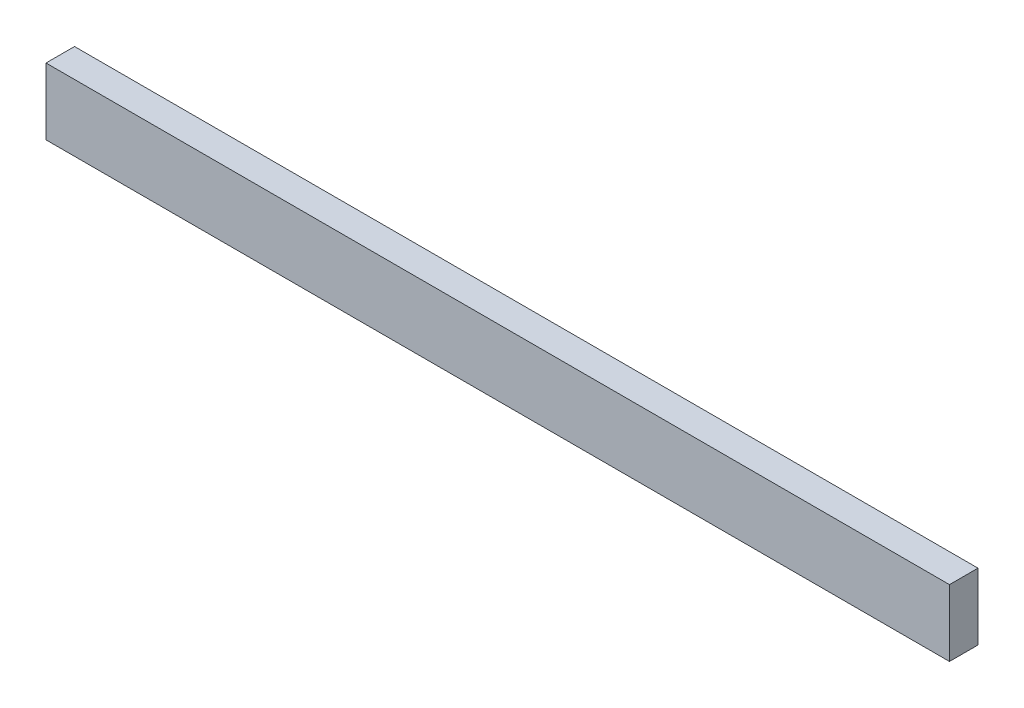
from build123d import *

# Parameters (mm, degrees)
ESQUISSE1_W        = 190
ESQUISSE1_H        = 14
BOSS_EXTRU_1_DEPTH = 6


with BuildPart() as part:
    # Esquisse1 → Boss.-Extru.1 (new body)
    with BuildSketch(Plane.XY):
        with Locations((95, 7)):
            Rectangle(ESQUISSE1_W, ESQUISSE1_H)
    extrude(amount=BOSS_EXTRU_1_DEPTH)


solid = part.part
